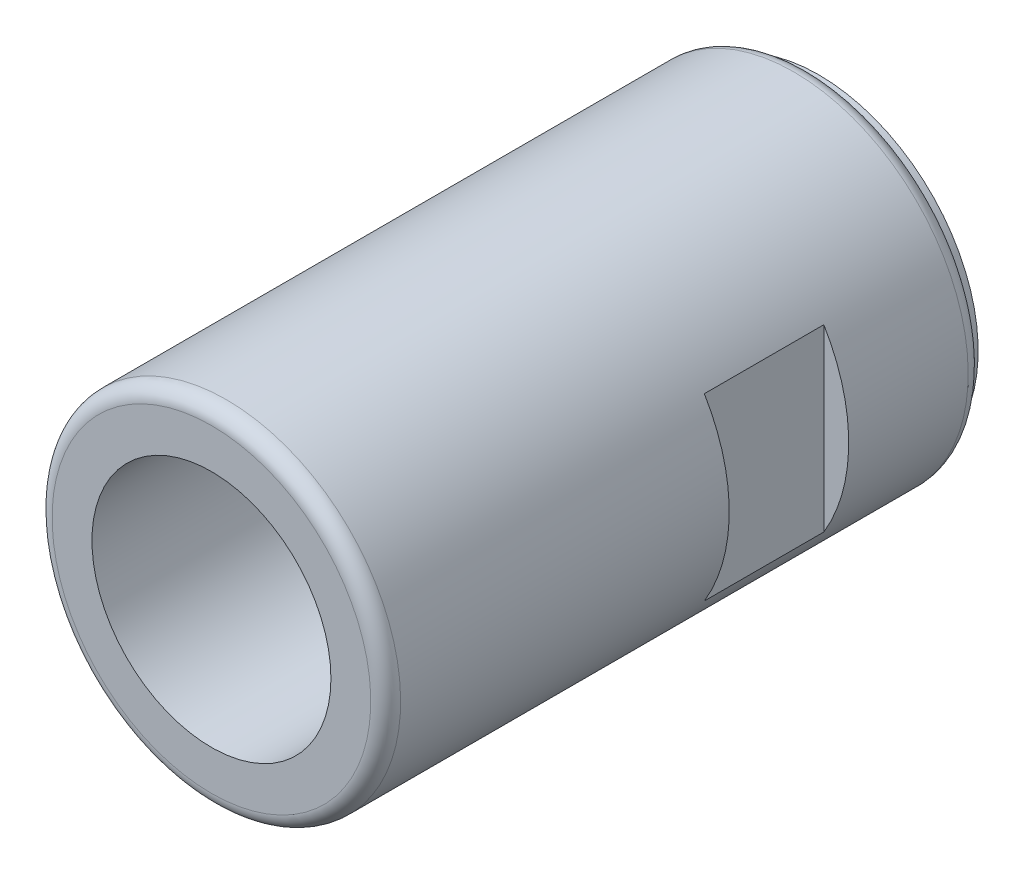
ISO-10303-21;
HEADER;
FILE_DESCRIPTION(('STEP AP214'),'2;1');
FILE_NAME('part.step','',(''),(''),'','','');
FILE_SCHEMA(('AUTOMOTIVE_DESIGN { 1 0 10303 214 1 1 1 1 }'));
ENDSEC;
DATA;
#1=APPLICATION_CONTEXT('core data for automotive mechanical design processes');
#2=APPLICATION_PROTOCOL_DEFINITION('international standard','automotive_design',2000,#1);
#3=PRODUCT_CONTEXT('',#1,'mechanical');
#4=PRODUCT('Part','Part','',(#3));
#5=PRODUCT_RELATED_PRODUCT_CATEGORY('part','',(#4));
#6=PRODUCT_DEFINITION_FORMATION('','',#4);
#7=PRODUCT_DEFINITION_CONTEXT('part definition',#1,'design');
#8=PRODUCT_DEFINITION('design','',#6,#7);
#9=PRODUCT_DEFINITION_SHAPE('','',#8);
#10=(LENGTH_UNIT() NAMED_UNIT(*) SI_UNIT(.MILLI.,.METRE.));
#11=(NAMED_UNIT(*) PLANE_ANGLE_UNIT() SI_UNIT($,.RADIAN.));
#12=(NAMED_UNIT(*) SI_UNIT($,.STERADIAN.) SOLID_ANGLE_UNIT());
#13=UNCERTAINTY_MEASURE_WITH_UNIT(LENGTH_MEASURE(1.E-05),#10,'distance_accuracy_value','');
#14=(GEOMETRIC_REPRESENTATION_CONTEXT(3) GLOBAL_UNCERTAINTY_ASSIGNED_CONTEXT((#13)) GLOBAL_UNIT_ASSIGNED_CONTEXT((#10,
#11,#12)) REPRESENTATION_CONTEXT('',''));
#15=CARTESIAN_POINT('',(0.,0.,0.));
#16=DIRECTION('',(0.,0.,1.));
#17=DIRECTION('',(1.,0.,0.));
#18=AXIS2_PLACEMENT_3D('',#15,#16,#17);
#19=CARTESIAN_POINT('',(0.,0.,0.));
#20=DIRECTION('',(0.,0.,1.));
#21=DIRECTION('',(0.,-1.,0.));
#22=AXIS2_PLACEMENT_3D('',#19,#20,#21);
#23=CYLINDRICAL_SURFACE('',#22,16.);
#24=CARTESIAN_POINT('',(0.,0.,0.));
#25=DIRECTION('',(0.,0.,-1.));
#26=DIRECTION('',(0.,1.,0.));
#27=AXIS2_PLACEMENT_3D('',#24,#25,#26);
#28=CIRCLE('',#27,16.);
#29=CARTESIAN_POINT('',(0.,16.,0.));
#30=VERTEX_POINT('',#29);
#31=EDGE_CURVE('E92',#30,#30,#28,.T.);
#32=ORIENTED_EDGE('',*,*,#31,.F.);
#33=EDGE_LOOP('',(#32));
#34=FACE_BOUND('',#33,.T.);
#35=CARTESIAN_POINT('',(0.,0.,1.));
#36=DIRECTION('',(0.,0.,-1.));
#37=DIRECTION('',(0.,1.,0.));
#38=AXIS2_PLACEMENT_3D('',#35,#36,#37);
#39=CIRCLE('',#38,16.);
#40=CARTESIAN_POINT('',(0.,16.,1.));
#41=VERTEX_POINT('',#40);
#42=EDGE_CURVE('E78',#41,#41,#39,.T.);
#43=ORIENTED_EDGE('',*,*,#42,.T.);
#44=EDGE_LOOP('',(#43));
#45=FACE_BOUND('',#44,.T.);
#46=ADVANCED_FACE('F14',(#34,#45),#23,.T.);
#47=CARTESIAN_POINT('',(0.,0.,0.));
#48=DIRECTION('',(0.,0.,-1.));
#49=DIRECTION('',(0.,1.,0.));
#50=AXIS2_PLACEMENT_3D('',#47,#48,#49);
#51=PLANE('',#50);
#52=CARTESIAN_POINT('',(0.,0.,0.));
#53=DIRECTION('',(0.,0.,1.));
#54=DIRECTION('',(1.,0.,0.));
#55=AXIS2_PLACEMENT_3D('',#52,#53,#54);
#56=CIRCLE('',#55,12.);
#57=CARTESIAN_POINT('',(12.,0.,0.));
#58=VERTEX_POINT('',#57);
#59=EDGE_CURVE('E101',#58,#58,#56,.T.);
#60=ORIENTED_EDGE('',*,*,#59,.T.);
#61=EDGE_LOOP('',(#60));
#62=FACE_BOUND('',#61,.T.);
#63=ORIENTED_EDGE('',*,*,#31,.T.);
#64=EDGE_LOOP('',(#63));
#65=FACE_BOUND('',#64,.T.);
#66=ADVANCED_FACE('F105',(#62,#65),#51,.T.);
#67=CARTESIAN_POINT('',(16.,0.,61.));
#68=DIRECTION('',(0.,0.,1.));
#69=DIRECTION('',(0.,-1.,0.));
#70=AXIS2_PLACEMENT_3D('',#67,#68,#69);
#71=PLANE('',#70);
#72=CARTESIAN_POINT('',(0.,0.,61.));
#73=DIRECTION('',(0.,0.,1.));
#74=DIRECTION('',(1.,0.,0.));
#75=AXIS2_PLACEMENT_3D('',#72,#73,#74);
#76=CIRCLE('',#75,12.);
#77=CARTESIAN_POINT('',(12.,0.,61.));
#78=VERTEX_POINT('',#77);
#79=EDGE_CURVE('E98',#78,#78,#76,.T.);
#80=ORIENTED_EDGE('',*,*,#79,.F.);
#81=EDGE_LOOP('',(#80));
#82=FACE_BOUND('',#81,.T.);
#83=CARTESIAN_POINT('',(0.,0.,61.));
#84=DIRECTION('',(0.,0.,-1.));
#85=DIRECTION('',(0.,1.,0.));
#86=AXIS2_PLACEMENT_3D('',#83,#84,#85);
#87=CIRCLE('',#86,16.);
#88=CARTESIAN_POINT('',(0.,16.,61.));
#89=VERTEX_POINT('',#88);
#90=EDGE_CURVE('E87',#89,#89,#87,.T.);
#91=ORIENTED_EDGE('',*,*,#90,.F.);
#92=EDGE_LOOP('',(#91));
#93=FACE_BOUND('',#92,.T.);
#94=ADVANCED_FACE('F16',(#82,#93),#71,.T.);
#95=CARTESIAN_POINT('',(0.,0.,14.5));
#96=DIRECTION('',(0.,0.,1.));
#97=DIRECTION('',(0.,-1.,0.));
#98=AXIS2_PLACEMENT_3D('',#95,#96,#97);
#99=PLANE('',#98);
#100=DIRECTION('',(0.,-1.,0.));
#101=VECTOR('',#100,1.);
#102=CARTESIAN_POINT('',(-15.,35.,14.5));
#103=LINE('',#102,#101);
#104=CARTESIAN_POINT('',(-15.,9.01387818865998,14.5));
#105=VERTEX_POINT('',#104);
#106=CARTESIAN_POINT('',(-15.,-9.01387818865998,14.5));
#107=VERTEX_POINT('',#106);
#108=EDGE_CURVE('E30',#105,#107,#103,.T.);
#109=ORIENTED_EDGE('',*,*,#108,.F.);
#110=CARTESIAN_POINT('',(0.,0.,14.5));
#111=DIRECTION('',(0.,0.,1.));
#112=DIRECTION('',(0.,-1.,0.));
#113=AXIS2_PLACEMENT_3D('',#110,#111,#112);
#114=CIRCLE('',#113,17.5);
#115=EDGE_CURVE('E54',#107,#105,#114,.F.);
#116=ORIENTED_EDGE('',*,*,#115,.F.);
#117=EDGE_LOOP('',(#109,#116));
#118=FACE_BOUND('',#117,.T.);
#119=ADVANCED_FACE('F55',(#118),#99,.T.);
#120=CARTESIAN_POINT('',(-15.,35.,26.5));
#121=DIRECTION('',(1.,0.,0.));
#122=DIRECTION('',(0.,1.,0.));
#123=AXIS2_PLACEMENT_3D('',#120,#121,#122);
#124=PLANE('',#123);
#125=DIRECTION('',(0.,0.,-1.));
#126=VECTOR('',#125,1.);
#127=CARTESIAN_POINT('',(-15.,-9.01387818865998,1.));
#128=LINE('',#127,#126);
#129=CARTESIAN_POINT('',(-15.,-9.01387818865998,26.5));
#130=VERTEX_POINT('',#129);
#131=EDGE_CURVE('E18',#107,#130,#128,.F.);
#132=ORIENTED_EDGE('',*,*,#131,.T.);
#133=DIRECTION('',(0.,-1.,0.));
#134=VECTOR('',#133,1.);
#135=CARTESIAN_POINT('',(-15.,35.,26.5));
#136=LINE('',#135,#134);
#137=CARTESIAN_POINT('',(-15.,9.01387818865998,26.5));
#138=VERTEX_POINT('',#137);
#139=EDGE_CURVE('E89',#138,#130,#136,.T.);
#140=ORIENTED_EDGE('',*,*,#139,.F.);
#141=DIRECTION('',(0.,0.,-1.));
#142=VECTOR('',#141,1.);
#143=CARTESIAN_POINT('',(-15.,9.01387818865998,1.));
#144=LINE('',#143,#142);
#145=EDGE_CURVE('E59',#138,#105,#144,.T.);
#146=ORIENTED_EDGE('',*,*,#145,.T.);
#147=ORIENTED_EDGE('',*,*,#108,.T.);
#148=EDGE_LOOP('',(#132,#140,#146,#147));
#149=FACE_BOUND('',#148,.T.);
#150=ADVANCED_FACE('F63',(#149),#124,.F.);
#151=CARTESIAN_POINT('',(0.,0.,26.5));
#152=DIRECTION('',(0.,0.,1.));
#153=DIRECTION('',(0.,-1.,0.));
#154=AXIS2_PLACEMENT_3D('',#151,#152,#153);
#155=PLANE('',#154);
#156=CARTESIAN_POINT('',(0.,0.,26.5));
#157=DIRECTION('',(0.,0.,1.));
#158=DIRECTION('',(0.,-1.,0.));
#159=AXIS2_PLACEMENT_3D('',#156,#157,#158);
#160=CIRCLE('',#159,17.5);
#161=EDGE_CURVE('E9',#130,#138,#160,.F.);
#162=ORIENTED_EDGE('',*,*,#161,.T.);
#163=ORIENTED_EDGE('',*,*,#139,.T.);
#164=EDGE_LOOP('',(#162,#163));
#165=FACE_BOUND('',#164,.T.);
#166=ADVANCED_FACE('F134',(#165),#155,.F.);
#167=DIRECTION('',(0.,1.,0.));
#168=VECTOR('',#167,1.);
#169=CARTESIAN_POINT('',(15.,-35.,26.5));
#170=LINE('',#169,#168);
#171=CARTESIAN_POINT('',(15.,-9.01387818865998,26.5));
#172=VERTEX_POINT('',#171);
#173=CARTESIAN_POINT('',(15.,9.01387818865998,26.5));
#174=VERTEX_POINT('',#173);
#175=EDGE_CURVE('E66',#172,#174,#170,.T.);
#176=ORIENTED_EDGE('',*,*,#175,.T.);
#177=EDGE_CURVE('E24',#174,#172,#160,.F.);
#178=ORIENTED_EDGE('',*,*,#177,.T.);
#179=EDGE_LOOP('',(#176,#178));
#180=FACE_BOUND('',#179,.T.);
#181=ADVANCED_FACE('F130',(#180),#155,.F.);
#182=DIRECTION('',(0.,1.,0.));
#183=VECTOR('',#182,1.);
#184=CARTESIAN_POINT('',(15.,-35.,14.5));
#185=LINE('',#184,#183);
#186=CARTESIAN_POINT('',(15.,-9.01387818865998,14.5));
#187=VERTEX_POINT('',#186);
#188=CARTESIAN_POINT('',(15.,9.01387818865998,14.5));
#189=VERTEX_POINT('',#188);
#190=EDGE_CURVE('E37',#187,#189,#185,.T.);
#191=ORIENTED_EDGE('',*,*,#190,.F.);
#192=EDGE_CURVE('E61',#189,#187,#114,.F.);
#193=ORIENTED_EDGE('',*,*,#192,.F.);
#194=EDGE_LOOP('',(#191,#193));
#195=FACE_BOUND('',#194,.T.);
#196=ADVANCED_FACE('F133',(#195),#99,.T.);
#197=CARTESIAN_POINT('',(15.,-35.,26.5));
#198=DIRECTION('',(-1.,0.,0.));
#199=DIRECTION('',(0.,-1.,0.));
#200=AXIS2_PLACEMENT_3D('',#197,#198,#199);
#201=PLANE('',#200);
#202=DIRECTION('',(0.,0.,-1.));
#203=VECTOR('',#202,1.);
#204=CARTESIAN_POINT('',(15.,9.01387818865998,1.));
#205=LINE('',#204,#203);
#206=EDGE_CURVE('E72',#189,#174,#205,.F.);
#207=ORIENTED_EDGE('',*,*,#206,.T.);
#208=ORIENTED_EDGE('',*,*,#175,.F.);
#209=DIRECTION('',(0.,0.,-1.));
#210=VECTOR('',#209,1.);
#211=CARTESIAN_POINT('',(15.,-9.01387818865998,1.));
#212=LINE('',#211,#210);
#213=EDGE_CURVE('E75',#172,#187,#212,.T.);
#214=ORIENTED_EDGE('',*,*,#213,.T.);
#215=ORIENTED_EDGE('',*,*,#190,.T.);
#216=EDGE_LOOP('',(#207,#208,#214,#215));
#217=FACE_BOUND('',#216,.T.);
#218=ADVANCED_FACE('F138',(#217),#201,.F.);
#219=CARTESIAN_POINT('',(0.,0.,59.5));
#220=DIRECTION('',(0.,0.,-1.));
#221=DIRECTION('',(0.,1.,0.));
#222=AXIS2_PLACEMENT_3D('',#219,#220,#221);
#223=TOROIDAL_SURFACE('',#222,16.,1.5);
#224=ORIENTED_EDGE('',*,*,#90,.T.);
#225=EDGE_LOOP('',(#224));
#226=FACE_BOUND('',#225,.T.);
#227=CARTESIAN_POINT('',(0.,0.,59.5));
#228=DIRECTION('',(0.,0.,-1.));
#229=DIRECTION('',(0.,1.,0.));
#230=AXIS2_PLACEMENT_3D('',#227,#228,#229);
#231=CIRCLE('',#230,17.5);
#232=CARTESIAN_POINT('',(0.,17.5,59.5));
#233=VERTEX_POINT('',#232);
#234=EDGE_CURVE('E84',#233,#233,#231,.T.);
#235=ORIENTED_EDGE('',*,*,#234,.F.);
#236=EDGE_LOOP('',(#235));
#237=FACE_BOUND('',#236,.T.);
#238=ADVANCED_FACE('F143',(#226,#237),#223,.T.);
#239=CARTESIAN_POINT('',(0.,0.,1.));
#240=DIRECTION('',(0.,0.,-1.));
#241=DIRECTION('',(0.,1.,0.));
#242=AXIS2_PLACEMENT_3D('',#239,#240,#241);
#243=CYLINDRICAL_SURFACE('',#242,17.5);
#244=ORIENTED_EDGE('',*,*,#234,.T.);
#245=EDGE_LOOP('',(#244));
#246=FACE_BOUND('',#245,.T.);
#247=ORIENTED_EDGE('',*,*,#206,.F.);
#248=ORIENTED_EDGE('',*,*,#192,.T.);
#249=ORIENTED_EDGE('',*,*,#213,.F.);
#250=ORIENTED_EDGE('',*,*,#177,.F.);
#251=EDGE_LOOP('',(#247,#248,#249,#250));
#252=FACE_BOUND('',#251,.T.);
#253=ORIENTED_EDGE('',*,*,#161,.F.);
#254=ORIENTED_EDGE('',*,*,#131,.F.);
#255=ORIENTED_EDGE('',*,*,#115,.T.);
#256=ORIENTED_EDGE('',*,*,#145,.F.);
#257=EDGE_LOOP('',(#253,#254,#255,#256));
#258=FACE_BOUND('',#257,.T.);
#259=CARTESIAN_POINT('',(0.,0.,2.5));
#260=DIRECTION('',(0.,0.,-1.));
#261=DIRECTION('',(0.,1.,0.));
#262=AXIS2_PLACEMENT_3D('',#259,#260,#261);
#263=CIRCLE('',#262,17.5);
#264=CARTESIAN_POINT('',(0.,17.5,2.5));
#265=VERTEX_POINT('',#264);
#266=EDGE_CURVE('E81',#265,#265,#263,.T.);
#267=ORIENTED_EDGE('',*,*,#266,.F.);
#268=EDGE_LOOP('',(#267));
#269=FACE_BOUND('',#268,.T.);
#270=ADVANCED_FACE('F69',(#246,#252,#258,#269),#243,.T.);
#271=CARTESIAN_POINT('',(0.,0.,2.5));
#272=DIRECTION('',(0.,0.,-1.));
#273=DIRECTION('',(0.,1.,0.));
#274=AXIS2_PLACEMENT_3D('',#271,#272,#273);
#275=TOROIDAL_SURFACE('',#274,16.,1.5);
#276=ORIENTED_EDGE('',*,*,#266,.T.);
#277=EDGE_LOOP('',(#276));
#278=FACE_BOUND('',#277,.T.);
#279=ORIENTED_EDGE('',*,*,#42,.F.);
#280=EDGE_LOOP('',(#279));
#281=FACE_BOUND('',#280,.T.);
#282=ADVANCED_FACE('F110',(#278,#281),#275,.T.);
#283=CARTESIAN_POINT('',(0.,0.,0.));
#284=DIRECTION('',(0.,0.,1.));
#285=DIRECTION('',(1.,0.,0.));
#286=AXIS2_PLACEMENT_3D('',#283,#284,#285);
#287=CYLINDRICAL_SURFACE('',#286,12.);
#288=ORIENTED_EDGE('',*,*,#79,.T.);
#289=EDGE_LOOP('',(#288));
#290=FACE_BOUND('',#289,.T.);
#291=ORIENTED_EDGE('',*,*,#59,.F.);
#292=EDGE_LOOP('',(#291));
#293=FACE_BOUND('',#292,.T.);
#294=ADVANCED_FACE('F108',(#290,#293),#287,.F.);
#295=CLOSED_SHELL('',(#46,#66,#94,#119,#150,#166,#181,#196,#218,#238,#270,#282,#294));
#296=MANIFOLD_SOLID_BREP('B1',#295);
#297=ADVANCED_BREP_SHAPE_REPRESENTATION('',(#18,#296),#14);
#298=SHAPE_DEFINITION_REPRESENTATION(#9,#297);
ENDSEC;
END-ISO-10303-21;
